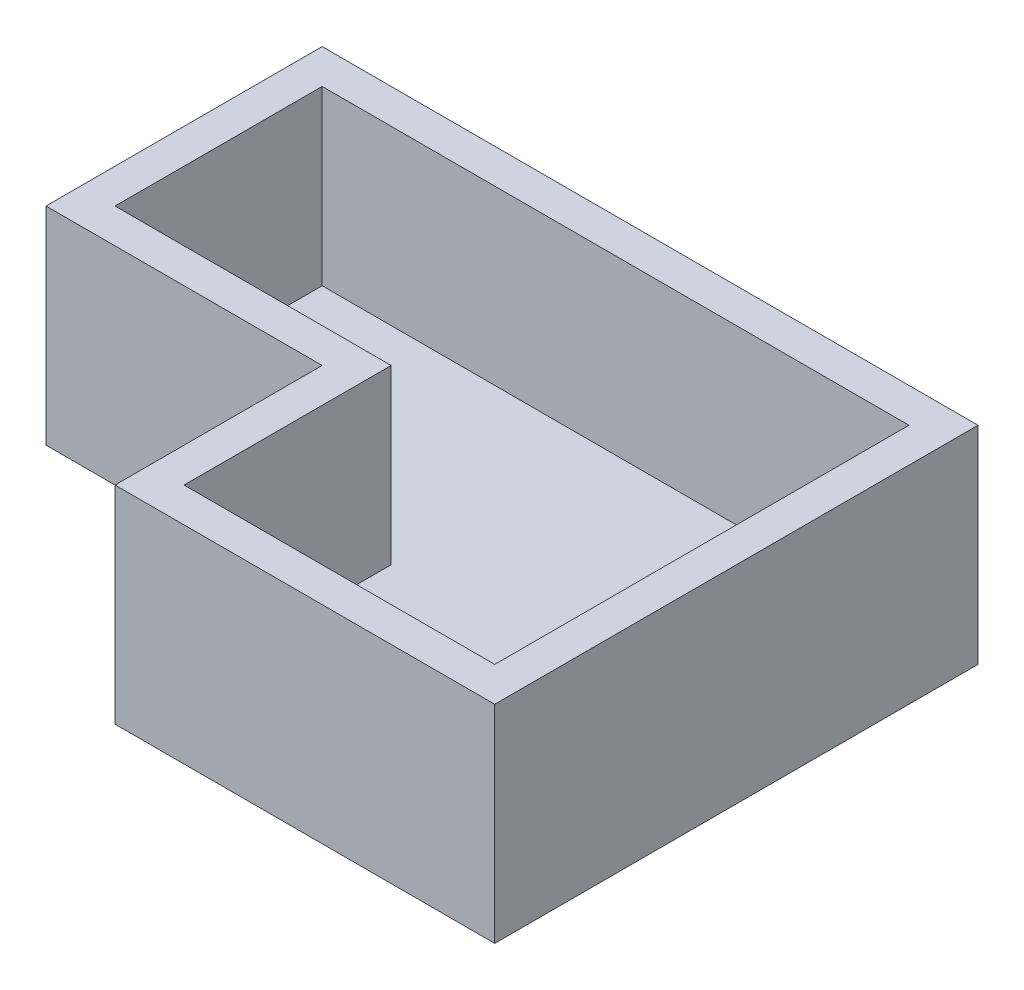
ISO-10303-21;
HEADER;
FILE_DESCRIPTION(('STEP AP214'),'2;1');
FILE_NAME('part.step','',(''),(''),'','','');
FILE_SCHEMA(('AUTOMOTIVE_DESIGN { 1 0 10303 214 1 1 1 1 }'));
ENDSEC;
DATA;
#1=APPLICATION_CONTEXT('core data for automotive mechanical design processes');
#2=APPLICATION_PROTOCOL_DEFINITION('international standard','automotive_design',2000,#1);
#3=PRODUCT_CONTEXT('',#1,'mechanical');
#4=PRODUCT('Part','Part','',(#3));
#5=PRODUCT_RELATED_PRODUCT_CATEGORY('part','',(#4));
#6=PRODUCT_DEFINITION_FORMATION('','',#4);
#7=PRODUCT_DEFINITION_CONTEXT('part definition',#1,'design');
#8=PRODUCT_DEFINITION('design','',#6,#7);
#9=PRODUCT_DEFINITION_SHAPE('','',#8);
#10=(LENGTH_UNIT() NAMED_UNIT(*) SI_UNIT(.MILLI.,.METRE.));
#11=(NAMED_UNIT(*) PLANE_ANGLE_UNIT() SI_UNIT($,.RADIAN.));
#12=(NAMED_UNIT(*) SI_UNIT($,.STERADIAN.) SOLID_ANGLE_UNIT());
#13=UNCERTAINTY_MEASURE_WITH_UNIT(LENGTH_MEASURE(1.E-05),#10,'distance_accuracy_value','');
#14=(GEOMETRIC_REPRESENTATION_CONTEXT(3) GLOBAL_UNCERTAINTY_ASSIGNED_CONTEXT((#13)) GLOBAL_UNIT_ASSIGNED_CONTEXT((#10,
#11,#12)) REPRESENTATION_CONTEXT('',''));
#15=CARTESIAN_POINT('',(0.,0.,0.));
#16=DIRECTION('',(0.,0.,1.));
#17=DIRECTION('',(1.,0.,0.));
#18=AXIS2_PLACEMENT_3D('',#15,#16,#17);
#19=CARTESIAN_POINT('',(0.,60.,0.));
#20=DIRECTION('',(0.,1.,0.));
#21=DIRECTION('',(0.,0.,1.));
#22=AXIS2_PLACEMENT_3D('',#19,#20,#21);
#23=PLANE('',#22);
#24=DIRECTION('',(0.,0.,1.));
#25=VECTOR('',#24,1.);
#26=CARTESIAN_POINT('',(-79.5708154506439,60.,0.));
#27=LINE('',#26,#25);
#28=CARTESIAN_POINT('',(-79.5708154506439,60.,-73.0901287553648));
#29=VERTEX_POINT('',#28);
#30=CARTESIAN_POINT('',(-79.5708154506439,60.,6.90987124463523));
#31=VERTEX_POINT('',#30);
#32=EDGE_CURVE('E231',#29,#31,#27,.T.);
#33=ORIENTED_EDGE('',*,*,#32,.T.);
#34=DIRECTION('',(1.,0.,0.));
#35=VECTOR('',#34,1.);
#36=CARTESIAN_POINT('',(0.,60.,6.90987124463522));
#37=LINE('',#36,#35);
#38=CARTESIAN_POINT('',(0.429184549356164,60.,6.90987124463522));
#39=VERTEX_POINT('',#38);
#40=EDGE_CURVE('E235',#31,#39,#37,.T.);
#41=ORIENTED_EDGE('',*,*,#40,.T.);
#42=DIRECTION('',(0.,0.,1.));
#43=VECTOR('',#42,1.);
#44=CARTESIAN_POINT('',(0.429184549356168,60.,0.));
#45=LINE('',#44,#43);
#46=CARTESIAN_POINT('',(0.429184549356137,60.,66.9098712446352));
#47=VERTEX_POINT('',#46);
#48=EDGE_CURVE('E239',#39,#47,#45,.T.);
#49=ORIENTED_EDGE('',*,*,#48,.T.);
#50=DIRECTION('',(1.,0.,0.));
#51=VECTOR('',#50,1.);
#52=CARTESIAN_POINT('',(0.,60.,66.9098712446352));
#53=LINE('',#52,#51);
#54=CARTESIAN_POINT('',(110.429184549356,60.,66.9098712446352));
#55=VERTEX_POINT('',#54);
#56=EDGE_CURVE('E242',#47,#55,#53,.T.);
#57=ORIENTED_EDGE('',*,*,#56,.T.);
#58=DIRECTION('',(0.,0.,-1.));
#59=VECTOR('',#58,1.);
#60=CARTESIAN_POINT('',(110.429184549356,60.,0.));
#61=LINE('',#60,#59);
#62=CARTESIAN_POINT('',(110.429184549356,60.,-73.0901287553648));
#63=VERTEX_POINT('',#62);
#64=EDGE_CURVE('E245',#55,#63,#61,.T.);
#65=ORIENTED_EDGE('',*,*,#64,.T.);
#66=DIRECTION('',(-1.,0.,0.));
#67=VECTOR('',#66,1.);
#68=CARTESIAN_POINT('',(0.,60.,-73.0901287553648));
#69=LINE('',#68,#67);
#70=EDGE_CURVE('E248',#63,#29,#69,.T.);
#71=ORIENTED_EDGE('',*,*,#70,.T.);
#72=EDGE_LOOP('',(#33,#41,#49,#57,#65,#71));
#73=FACE_BOUND('',#72,.T.);
#74=DIRECTION('',(1.,0.,0.));
#75=VECTOR('',#74,1.);
#76=CARTESIAN_POINT('',(10.4291845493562,60.,-3.09012875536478));
#77=LINE('',#76,#75);
#78=CARTESIAN_POINT('',(-69.5708154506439,60.,-3.09012875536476));
#79=VERTEX_POINT('',#78);
#80=CARTESIAN_POINT('',(10.4291845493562,60.,-3.09012875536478));
#81=VERTEX_POINT('',#80);
#82=EDGE_CURVE('E196',#79,#81,#77,.T.);
#83=ORIENTED_EDGE('',*,*,#82,.F.);
#84=DIRECTION('',(0.,0.,1.));
#85=VECTOR('',#84,1.);
#86=CARTESIAN_POINT('',(-69.5708154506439,60.,-3.09012875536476));
#87=LINE('',#86,#85);
#88=CARTESIAN_POINT('',(-69.5708154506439,60.,-63.0901287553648));
#89=VERTEX_POINT('',#88);
#90=EDGE_CURVE('E192',#89,#79,#87,.T.);
#91=ORIENTED_EDGE('',*,*,#90,.F.);
#92=DIRECTION('',(-1.,0.,0.));
#93=VECTOR('',#92,1.);
#94=CARTESIAN_POINT('',(-69.5708154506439,60.,-63.0901287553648));
#95=LINE('',#94,#93);
#96=CARTESIAN_POINT('',(100.429184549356,60.,-63.0901287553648));
#97=VERTEX_POINT('',#96);
#98=EDGE_CURVE('E174',#97,#89,#95,.T.);
#99=ORIENTED_EDGE('',*,*,#98,.F.);
#100=DIRECTION('',(0.,0.,-1.));
#101=VECTOR('',#100,1.);
#102=CARTESIAN_POINT('',(100.429184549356,60.,-63.0901287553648));
#103=LINE('',#102,#101);
#104=CARTESIAN_POINT('',(100.429184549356,60.,56.9098712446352));
#105=VERTEX_POINT('',#104);
#106=EDGE_CURVE('E210',#105,#97,#103,.T.);
#107=ORIENTED_EDGE('',*,*,#106,.F.);
#108=DIRECTION('',(1.,0.,0.));
#109=VECTOR('',#108,1.);
#110=CARTESIAN_POINT('',(100.429184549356,60.,56.9098712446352));
#111=LINE('',#110,#109);
#112=CARTESIAN_POINT('',(10.4291845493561,60.,56.9098712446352));
#113=VERTEX_POINT('',#112);
#114=EDGE_CURVE('E207',#113,#105,#111,.T.);
#115=ORIENTED_EDGE('',*,*,#114,.F.);
#116=DIRECTION('',(0.,0.,1.));
#117=VECTOR('',#116,1.);
#118=CARTESIAN_POINT('',(10.4291845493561,60.,56.9098712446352));
#119=LINE('',#118,#117);
#120=EDGE_CURVE('E204',#81,#113,#119,.T.);
#121=ORIENTED_EDGE('',*,*,#120,.F.);
#122=EDGE_LOOP('',(#83,#91,#99,#107,#115,#121));
#123=FACE_BOUND('',#122,.T.);
#124=ADVANCED_FACE('F75',(#73,#123),#23,.T.);
#125=CARTESIAN_POINT('',(0.,0.,0.));
#126=DIRECTION('',(0.,1.,0.));
#127=DIRECTION('',(0.,0.,1.));
#128=AXIS2_PLACEMENT_3D('',#125,#126,#127);
#129=PLANE('',#128);
#130=DIRECTION('',(0.,0.,1.));
#131=VECTOR('',#130,1.);
#132=CARTESIAN_POINT('',(-79.5708154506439,0.,0.));
#133=LINE('',#132,#131);
#134=CARTESIAN_POINT('',(-79.5708154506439,0.,-73.0901287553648));
#135=VERTEX_POINT('',#134);
#136=CARTESIAN_POINT('',(-79.5708154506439,0.,6.90987124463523));
#137=VERTEX_POINT('',#136);
#138=EDGE_CURVE('E230',#135,#137,#133,.T.);
#139=ORIENTED_EDGE('',*,*,#138,.F.);
#140=DIRECTION('',(-1.,0.,0.));
#141=VECTOR('',#140,1.);
#142=CARTESIAN_POINT('',(0.,0.,-73.0901287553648));
#143=LINE('',#142,#141);
#144=CARTESIAN_POINT('',(110.429184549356,0.,-73.0901287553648));
#145=VERTEX_POINT('',#144);
#146=EDGE_CURVE('E236',#145,#135,#143,.T.);
#147=ORIENTED_EDGE('',*,*,#146,.F.);
#148=DIRECTION('',(0.,0.,-1.));
#149=VECTOR('',#148,1.);
#150=CARTESIAN_POINT('',(110.429184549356,0.,0.));
#151=LINE('',#150,#149);
#152=CARTESIAN_POINT('',(110.429184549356,0.,66.9098712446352));
#153=VERTEX_POINT('',#152);
#154=EDGE_CURVE('E264',#153,#145,#151,.T.);
#155=ORIENTED_EDGE('',*,*,#154,.F.);
#156=DIRECTION('',(1.,0.,0.));
#157=VECTOR('',#156,1.);
#158=CARTESIAN_POINT('',(0.,0.,66.9098712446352));
#159=LINE('',#158,#157);
#160=CARTESIAN_POINT('',(0.429184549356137,0.,66.9098712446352));
#161=VERTEX_POINT('',#160);
#162=EDGE_CURVE('E261',#161,#153,#159,.T.);
#163=ORIENTED_EDGE('',*,*,#162,.F.);
#164=DIRECTION('',(0.,0.,1.));
#165=VECTOR('',#164,1.);
#166=CARTESIAN_POINT('',(0.429184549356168,0.,0.));
#167=LINE('',#166,#165);
#168=CARTESIAN_POINT('',(0.429184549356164,0.,6.90987124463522));
#169=VERTEX_POINT('',#168);
#170=EDGE_CURVE('E258',#169,#161,#167,.T.);
#171=ORIENTED_EDGE('',*,*,#170,.F.);
#172=DIRECTION('',(1.,0.,0.));
#173=VECTOR('',#172,1.);
#174=CARTESIAN_POINT('',(0.,0.,6.90987124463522));
#175=LINE('',#174,#173);
#176=EDGE_CURVE('E255',#137,#169,#175,.T.);
#177=ORIENTED_EDGE('',*,*,#176,.F.);
#178=EDGE_LOOP('',(#139,#147,#155,#163,#171,#177));
#179=FACE_BOUND('',#178,.T.);
#180=ADVANCED_FACE('F295',(#179),#129,.F.);
#181=CARTESIAN_POINT('',(-79.5708154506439,60.,0.));
#182=DIRECTION('',(1.,0.,0.));
#183=DIRECTION('',(0.,0.,-1.));
#184=AXIS2_PLACEMENT_3D('',#181,#182,#183);
#185=PLANE('',#184);
#186=ORIENTED_EDGE('',*,*,#138,.T.);
#187=DIRECTION('',(0.,-1.,0.));
#188=VECTOR('',#187,1.);
#189=CARTESIAN_POINT('',(-79.5708154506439,60.,6.90987124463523));
#190=LINE('',#189,#188);
#191=EDGE_CURVE('E12',#31,#137,#190,.T.);
#192=ORIENTED_EDGE('',*,*,#191,.F.);
#193=ORIENTED_EDGE('',*,*,#32,.F.);
#194=DIRECTION('',(0.,-1.,0.));
#195=VECTOR('',#194,1.);
#196=CARTESIAN_POINT('',(-79.5708154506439,60.,-73.0901287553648));
#197=LINE('',#196,#195);
#198=EDGE_CURVE('E251',#29,#135,#197,.T.);
#199=ORIENTED_EDGE('',*,*,#198,.T.);
#200=EDGE_LOOP('',(#186,#192,#193,#199));
#201=FACE_BOUND('',#200,.T.);
#202=ADVANCED_FACE('F77',(#201),#185,.F.);
#203=CARTESIAN_POINT('',(0.,60.,6.90987124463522));
#204=DIRECTION('',(0.,0.,-1.));
#205=DIRECTION('',(-1.,0.,0.));
#206=AXIS2_PLACEMENT_3D('',#203,#204,#205);
#207=PLANE('',#206);
#208=ORIENTED_EDGE('',*,*,#176,.T.);
#209=DIRECTION('',(0.,-1.,0.));
#210=VECTOR('',#209,1.);
#211=CARTESIAN_POINT('',(0.429184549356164,60.,6.90987124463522));
#212=LINE('',#211,#210);
#213=EDGE_CURVE('E84',#39,#169,#212,.T.);
#214=ORIENTED_EDGE('',*,*,#213,.F.);
#215=ORIENTED_EDGE('',*,*,#40,.F.);
#216=ORIENTED_EDGE('',*,*,#191,.T.);
#217=EDGE_LOOP('',(#208,#214,#215,#216));
#218=FACE_BOUND('',#217,.T.);
#219=ADVANCED_FACE('F312',(#218),#207,.F.);
#220=CARTESIAN_POINT('',(0.429184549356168,60.,0.));
#221=DIRECTION('',(1.,0.,0.));
#222=DIRECTION('',(0.,0.,-1.));
#223=AXIS2_PLACEMENT_3D('',#220,#221,#222);
#224=PLANE('',#223);
#225=ORIENTED_EDGE('',*,*,#170,.T.);
#226=DIRECTION('',(0.,-1.,0.));
#227=VECTOR('',#226,1.);
#228=CARTESIAN_POINT('',(0.429184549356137,60.,66.9098712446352));
#229=LINE('',#228,#227);
#230=EDGE_CURVE('E280',#47,#161,#229,.T.);
#231=ORIENTED_EDGE('',*,*,#230,.F.);
#232=ORIENTED_EDGE('',*,*,#48,.F.);
#233=ORIENTED_EDGE('',*,*,#213,.T.);
#234=EDGE_LOOP('',(#225,#231,#232,#233));
#235=FACE_BOUND('',#234,.T.);
#236=ADVANCED_FACE('F289',(#235),#224,.F.);
#237=CARTESIAN_POINT('',(0.,60.,66.9098712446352));
#238=DIRECTION('',(0.,0.,-1.));
#239=DIRECTION('',(-1.,0.,0.));
#240=AXIS2_PLACEMENT_3D('',#237,#238,#239);
#241=PLANE('',#240);
#242=ORIENTED_EDGE('',*,*,#162,.T.);
#243=DIRECTION('',(0.,-1.,0.));
#244=VECTOR('',#243,1.);
#245=CARTESIAN_POINT('',(110.429184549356,60.,66.9098712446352));
#246=LINE('',#245,#244);
#247=EDGE_CURVE('E276',#55,#153,#246,.T.);
#248=ORIENTED_EDGE('',*,*,#247,.F.);
#249=ORIENTED_EDGE('',*,*,#56,.F.);
#250=ORIENTED_EDGE('',*,*,#230,.T.);
#251=EDGE_LOOP('',(#242,#248,#249,#250));
#252=FACE_BOUND('',#251,.T.);
#253=ADVANCED_FACE('F300',(#252),#241,.F.);
#254=CARTESIAN_POINT('',(110.429184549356,60.,0.));
#255=DIRECTION('',(-1.,0.,0.));
#256=DIRECTION('',(0.,0.,1.));
#257=AXIS2_PLACEMENT_3D('',#254,#255,#256);
#258=PLANE('',#257);
#259=ORIENTED_EDGE('',*,*,#154,.T.);
#260=DIRECTION('',(0.,-1.,0.));
#261=VECTOR('',#260,1.);
#262=CARTESIAN_POINT('',(110.429184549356,60.,-73.0901287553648));
#263=LINE('',#262,#261);
#264=EDGE_CURVE('E272',#63,#145,#263,.T.);
#265=ORIENTED_EDGE('',*,*,#264,.F.);
#266=ORIENTED_EDGE('',*,*,#64,.F.);
#267=ORIENTED_EDGE('',*,*,#247,.T.);
#268=EDGE_LOOP('',(#259,#265,#266,#267));
#269=FACE_BOUND('',#268,.T.);
#270=ADVANCED_FACE('F304',(#269),#258,.F.);
#271=CARTESIAN_POINT('',(0.,60.,-73.0901287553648));
#272=DIRECTION('',(0.,0.,1.));
#273=DIRECTION('',(1.,0.,0.));
#274=AXIS2_PLACEMENT_3D('',#271,#272,#273);
#275=PLANE('',#274);
#276=ORIENTED_EDGE('',*,*,#146,.T.);
#277=ORIENTED_EDGE('',*,*,#198,.F.);
#278=ORIENTED_EDGE('',*,*,#70,.F.);
#279=ORIENTED_EDGE('',*,*,#264,.T.);
#280=EDGE_LOOP('',(#276,#277,#278,#279));
#281=FACE_BOUND('',#280,.T.);
#282=ADVANCED_FACE('F315',(#281),#275,.F.);
#283=CARTESIAN_POINT('',(-69.5708154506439,60.,-3.09012875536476));
#284=DIRECTION('',(1.,0.,0.));
#285=DIRECTION('',(0.,0.,-1.));
#286=AXIS2_PLACEMENT_3D('',#283,#284,#285);
#287=PLANE('',#286);
#288=DIRECTION('',(0.,0.,1.));
#289=VECTOR('',#288,1.);
#290=CARTESIAN_POINT('',(-69.5708154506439,10.,-3.09012875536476));
#291=LINE('',#290,#289);
#292=CARTESIAN_POINT('',(-69.5708154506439,10.,-63.0901287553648));
#293=VERTEX_POINT('',#292);
#294=CARTESIAN_POINT('',(-69.5708154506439,10.,-3.09012875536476));
#295=VERTEX_POINT('',#294);
#296=EDGE_CURVE('E181',#293,#295,#291,.T.);
#297=ORIENTED_EDGE('',*,*,#296,.F.);
#298=DIRECTION('',(0.,-1.,0.));
#299=VECTOR('',#298,1.);
#300=CARTESIAN_POINT('',(-69.5708154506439,60.,-63.0901287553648));
#301=LINE('',#300,#299);
#302=EDGE_CURVE('E167',#89,#293,#301,.T.);
#303=ORIENTED_EDGE('',*,*,#302,.F.);
#304=ORIENTED_EDGE('',*,*,#90,.T.);
#305=DIRECTION('',(0.,-1.,0.));
#306=VECTOR('',#305,1.);
#307=CARTESIAN_POINT('',(-69.5708154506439,60.,-3.09012875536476));
#308=LINE('',#307,#306);
#309=EDGE_CURVE('E183',#79,#295,#308,.T.);
#310=ORIENTED_EDGE('',*,*,#309,.T.);
#311=EDGE_LOOP('',(#297,#303,#304,#310));
#312=FACE_BOUND('',#311,.T.);
#313=ADVANCED_FACE('F182',(#312),#287,.T.);
#314=CARTESIAN_POINT('',(10.4291845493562,60.,-3.09012875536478));
#315=DIRECTION('',(0.,0.,-1.));
#316=DIRECTION('',(-1.,0.,0.));
#317=AXIS2_PLACEMENT_3D('',#314,#315,#316);
#318=PLANE('',#317);
#319=DIRECTION('',(1.,0.,0.));
#320=VECTOR('',#319,1.);
#321=CARTESIAN_POINT('',(-69.5708154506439,10.,-3.09012875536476));
#322=LINE('',#321,#320);
#323=CARTESIAN_POINT('',(10.4291845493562,10.,-3.09012875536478));
#324=VERTEX_POINT('',#323);
#325=EDGE_CURVE('E91',#295,#324,#322,.T.);
#326=ORIENTED_EDGE('',*,*,#325,.F.);
#327=ORIENTED_EDGE('',*,*,#309,.F.);
#328=ORIENTED_EDGE('',*,*,#82,.T.);
#329=DIRECTION('',(0.,-1.,0.));
#330=VECTOR('',#329,1.);
#331=CARTESIAN_POINT('',(10.4291845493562,60.,-3.09012875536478));
#332=LINE('',#331,#330);
#333=EDGE_CURVE('E225',#81,#324,#332,.T.);
#334=ORIENTED_EDGE('',*,*,#333,.T.);
#335=EDGE_LOOP('',(#326,#327,#328,#334));
#336=FACE_BOUND('',#335,.T.);
#337=ADVANCED_FACE('F322',(#336),#318,.T.);
#338=CARTESIAN_POINT('',(10.4291845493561,60.,56.9098712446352));
#339=DIRECTION('',(1.,0.,0.));
#340=DIRECTION('',(0.,0.,-1.));
#341=AXIS2_PLACEMENT_3D('',#338,#339,#340);
#342=PLANE('',#341);
#343=DIRECTION('',(0.,0.,1.));
#344=VECTOR('',#343,1.);
#345=CARTESIAN_POINT('',(10.4291845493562,10.,-3.09012875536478));
#346=LINE('',#345,#344);
#347=CARTESIAN_POINT('',(10.4291845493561,10.,56.9098712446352));
#348=VERTEX_POINT('',#347);
#349=EDGE_CURVE('E99',#324,#348,#346,.T.);
#350=ORIENTED_EDGE('',*,*,#349,.F.);
#351=ORIENTED_EDGE('',*,*,#333,.F.);
#352=ORIENTED_EDGE('',*,*,#120,.T.);
#353=DIRECTION('',(0.,-1.,0.));
#354=VECTOR('',#353,1.);
#355=CARTESIAN_POINT('',(10.4291845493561,60.,56.9098712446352));
#356=LINE('',#355,#354);
#357=EDGE_CURVE('E222',#113,#348,#356,.T.);
#358=ORIENTED_EDGE('',*,*,#357,.T.);
#359=EDGE_LOOP('',(#350,#351,#352,#358));
#360=FACE_BOUND('',#359,.T.);
#361=ADVANCED_FACE('F334',(#360),#342,.T.);
#362=CARTESIAN_POINT('',(100.429184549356,60.,56.9098712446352));
#363=DIRECTION('',(0.,0.,-1.));
#364=DIRECTION('',(-1.,0.,0.));
#365=AXIS2_PLACEMENT_3D('',#362,#363,#364);
#366=PLANE('',#365);
#367=DIRECTION('',(1.,0.,0.));
#368=VECTOR('',#367,1.);
#369=CARTESIAN_POINT('',(10.4291845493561,10.,56.9098712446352));
#370=LINE('',#369,#368);
#371=CARTESIAN_POINT('',(100.429184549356,10.,56.9098712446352));
#372=VERTEX_POINT('',#371);
#373=EDGE_CURVE('E198',#348,#372,#370,.T.);
#374=ORIENTED_EDGE('',*,*,#373,.F.);
#375=ORIENTED_EDGE('',*,*,#357,.F.);
#376=ORIENTED_EDGE('',*,*,#114,.T.);
#377=DIRECTION('',(0.,-1.,0.));
#378=VECTOR('',#377,1.);
#379=CARTESIAN_POINT('',(100.429184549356,60.,56.9098712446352));
#380=LINE('',#379,#378);
#381=EDGE_CURVE('E218',#105,#372,#380,.T.);
#382=ORIENTED_EDGE('',*,*,#381,.T.);
#383=EDGE_LOOP('',(#374,#375,#376,#382));
#384=FACE_BOUND('',#383,.T.);
#385=ADVANCED_FACE('F337',(#384),#366,.T.);
#386=CARTESIAN_POINT('',(100.429184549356,60.,-63.0901287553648));
#387=DIRECTION('',(-1.,0.,0.));
#388=DIRECTION('',(0.,0.,1.));
#389=AXIS2_PLACEMENT_3D('',#386,#387,#388);
#390=PLANE('',#389);
#391=DIRECTION('',(0.,0.,-1.));
#392=VECTOR('',#391,1.);
#393=CARTESIAN_POINT('',(100.429184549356,10.,56.9098712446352));
#394=LINE('',#393,#392);
#395=CARTESIAN_POINT('',(100.429184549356,10.,-63.0901287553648));
#396=VERTEX_POINT('',#395);
#397=EDGE_CURVE('E190',#372,#396,#394,.T.);
#398=ORIENTED_EDGE('',*,*,#397,.F.);
#399=ORIENTED_EDGE('',*,*,#381,.F.);
#400=ORIENTED_EDGE('',*,*,#106,.T.);
#401=DIRECTION('',(0.,-1.,0.));
#402=VECTOR('',#401,1.);
#403=CARTESIAN_POINT('',(100.429184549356,60.,-63.0901287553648));
#404=LINE('',#403,#402);
#405=EDGE_CURVE('E178',#97,#396,#404,.T.);
#406=ORIENTED_EDGE('',*,*,#405,.T.);
#407=EDGE_LOOP('',(#398,#399,#400,#406));
#408=FACE_BOUND('',#407,.T.);
#409=ADVANCED_FACE('F340',(#408),#390,.T.);
#410=CARTESIAN_POINT('',(-69.5708154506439,60.,-63.0901287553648));
#411=DIRECTION('',(0.,0.,1.));
#412=DIRECTION('',(1.,0.,0.));
#413=AXIS2_PLACEMENT_3D('',#410,#411,#412);
#414=PLANE('',#413);
#415=DIRECTION('',(-1.,0.,0.));
#416=VECTOR('',#415,1.);
#417=CARTESIAN_POINT('',(100.429184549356,10.,-63.0901287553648));
#418=LINE('',#417,#416);
#419=EDGE_CURVE('E171',#396,#293,#418,.T.);
#420=ORIENTED_EDGE('',*,*,#419,.F.);
#421=ORIENTED_EDGE('',*,*,#405,.F.);
#422=ORIENTED_EDGE('',*,*,#98,.T.);
#423=ORIENTED_EDGE('',*,*,#302,.T.);
#424=EDGE_LOOP('',(#420,#421,#422,#423));
#425=FACE_BOUND('',#424,.T.);
#426=ADVANCED_FACE('F169',(#425),#414,.T.);
#427=CARTESIAN_POINT('',(0.,10.,0.));
#428=DIRECTION('',(0.,1.,0.));
#429=DIRECTION('',(0.,0.,1.));
#430=AXIS2_PLACEMENT_3D('',#427,#428,#429);
#431=PLANE('',#430);
#432=ORIENTED_EDGE('',*,*,#296,.T.);
#433=ORIENTED_EDGE('',*,*,#325,.T.);
#434=ORIENTED_EDGE('',*,*,#349,.T.);
#435=ORIENTED_EDGE('',*,*,#373,.T.);
#436=ORIENTED_EDGE('',*,*,#397,.T.);
#437=ORIENTED_EDGE('',*,*,#419,.T.);
#438=EDGE_LOOP('',(#432,#433,#434,#435,#436,#437));
#439=FACE_BOUND('',#438,.T.);
#440=ADVANCED_FACE('F188',(#439),#431,.T.);
#441=CLOSED_SHELL('',(#124,#180,#202,#219,#236,#253,#270,#282,#313,#337,#361,#385,#409,#426,#440));
#442=MANIFOLD_SOLID_BREP('B2',#441);
#443=ADVANCED_BREP_SHAPE_REPRESENTATION('',(#18,#442),#14);
#444=SHAPE_DEFINITION_REPRESENTATION(#9,#443);
ENDSEC;
END-ISO-10303-21;
